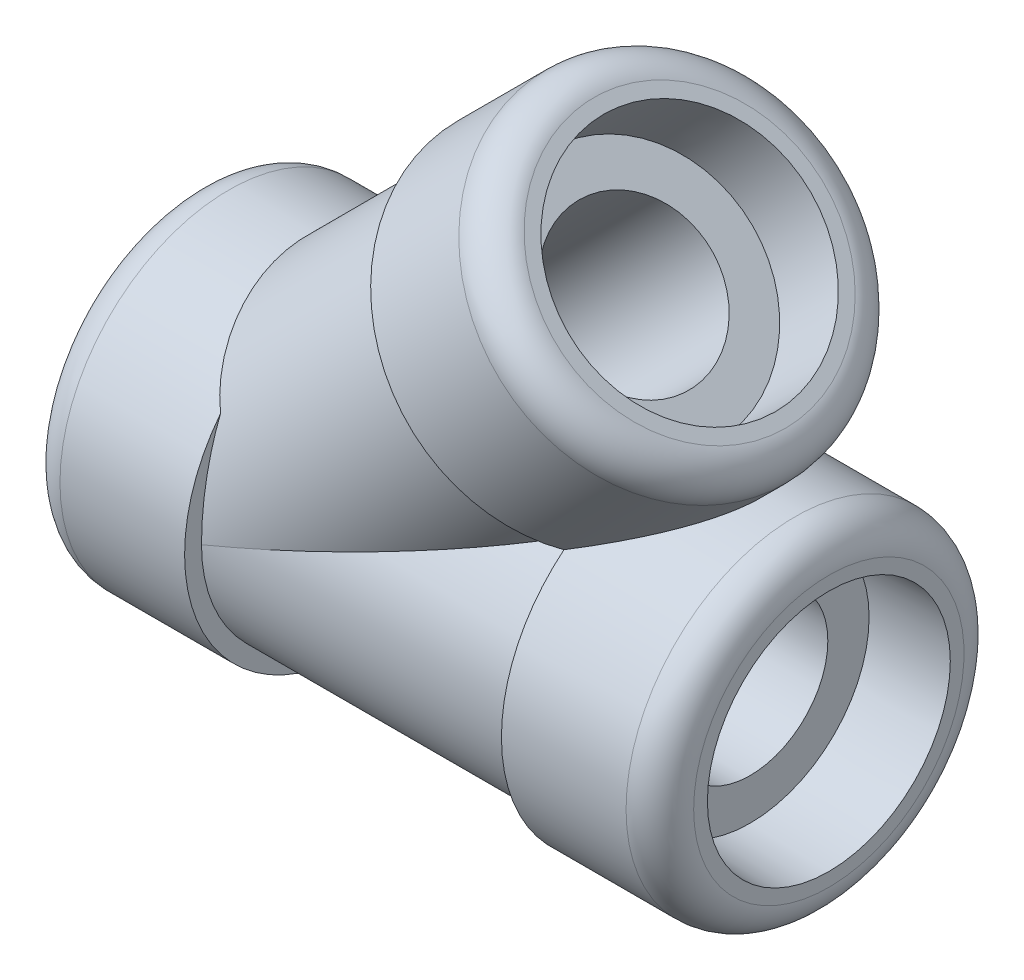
from build123d import *

# Parameters (mm, degrees)
FLOWSKETCH1_R        = 23.368
MAINFLOW_DEPTH       = 241.053937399
ANGLEFLOW_REACH      = 222.71
ANGLEFLOW_END_RADIUS = 23.368
FLOWSKETCH2_R        = 23.368
FILLET1_R            = 10.16


with BuildPart() as part:
    # BodySketch → Body (revolve)
    with BuildSketch(Plane.XY, mode=Mode.PRIVATE) as body_sk:
        Polygon((-47.625, 45.72), (47.625, 45.72), (47.625, 50.8), (95.25, 50.8), (95.25, 0), (-47.625, 0), align=None)
    body = revolve(body_sk.sketch.rotate(Axis((-149.415016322, 0, 0), (1, 0, 0)), 90), axis=Axis((-149.415016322, 0, 0), (1, 0, 0)))

    # Mirror1: Body across plane
    add(body.mirror(Plane(origin=(-6.974519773, 16.837980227, 0), x_dir=(0, 0, 1), z_dir=(-0.38268343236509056, 0.9238795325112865, 0))))

    # ThreadSketch → Thread (revolve, cut)
    with BuildSketch(Plane.XY, mode=Mode.PRIVATE) as thread_sk:
        Polygon((71.5772, 35.775445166), (95.25, 36.5125), (95.25, 0), (71.5772, 0), align=None)
    thread = revolve(thread_sk.sketch.rotate(Axis((28.224281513, 0, 0), (1, 0, 0)), 90), axis=Axis((28.224281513, 0, 0), (1, 0, 0)), mode=Mode.SUBTRACT)

    # Mirror2: Thread across plane
    add(thread.mirror(Plane(origin=(-6.974519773, 16.837980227, 0), x_dir=(0, 0, 1), z_dir=(-0.38268343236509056, 0.9238795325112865, 0))), mode=Mode.SUBTRACT)

    # Mirror3: Body, Thread across plane
    add(body.mirror(Plane(origin=(0, 0, 0), x_dir=(0, 0, 1), z_dir=(1, 0, 0))))
    add(thread.mirror(Plane(origin=(0, 0, 0), x_dir=(0, 0, 1), z_dir=(1, 0, 0))), mode=Mode.SUBTRACT)

    # FlowSketch1 → MainFlow (cut, through all)
    with BuildSketch(Plane(origin=(95.25, 0, 0), x_dir=(0, 0, -1), z_dir=(1, 0, 0))):
        Circle(FLOWSKETCH1_R)
    extrude(amount=-MAINFLOW_DEPTH, mode=Mode.SUBTRACT)

    # AngleFlow: up to this cylinder (the profile starts outside it)
    angleflow_end = Plane(origin=(53.402881, 0, 0), z_dir=(1, 0, 0)) * Cylinder(ANGLEFLOW_END_RADIUS, 493.156, mode=Mode.PRIVATE)
    # FlowSketch2 → AngleFlow (cut, up to the surface)
    with BuildSketch(Plane(origin=(77.215381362, 77.215381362, 0), x_dir=(-0.7071067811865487, 0.7071067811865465, 0), z_dir=(0.7071067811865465, 0.7071067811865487, 0)), mode=Mode.PRIVATE) as angleflow_sk1:
        with Locations((33.675960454, 0)):
            Circle(FLOWSKETCH2_R)
    angleflow_tool1 = extrude(angleflow_sk1.sketch, amount=-ANGLEFLOW_REACH, mode=Mode.PRIVATE) - angleflow_end
    add(angleflow_tool1.solids().sort_by_distance((53.402881, 101.027881, 0))[0], mode=Mode.SUBTRACT)

    # Fillet1
    fillet1_edges = [part.edges().sort_by_distance(p)[0] for p in [
        (53.402881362, 101.027881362, -50.8),
        (-95.25, 0, -50.8),
        (95.25, 0, -50.8),
    ]]
    fillet(fillet1_edges, radius=FILLET1_R)


solid = part.part
